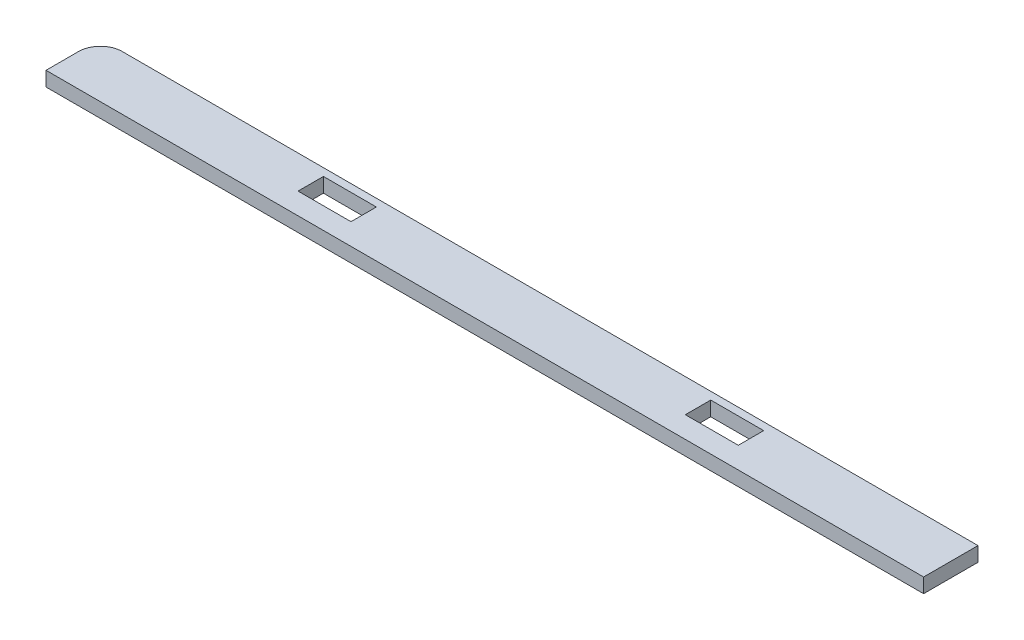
from build123d import *

# Parameters (mm, degrees)
SKETCH1_W           = 242
SKETCH1_H           = 15
BOSS_EXTRUDE1_DEPTH = 4
SKETCH2_W           = 14.6
SKETCH2_H           = 7
CUT_EXTRUDE1_DEPTH  = 172.166585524
SKETCH3_W           = 14.6
SKETCH3_H           = 7
CUT_EXTRUDE2_DEPTH  = 172.166585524
FILLET1_R           = 6


with BuildPart() as part:
    # Sketch1 → Boss-Extrude1 (new body)
    with BuildSketch(Plane(origin=(0, 3, 0), x_dir=(1, 0, 0), z_dir=(0, 1, 0))):
        with Locations((0, 113.5)):
            Rectangle(SKETCH1_W, SKETCH1_H)
    extrude(amount=-BOSS_EXTRUDE1_DEPTH)

    # Sketch2 → Cut-Extrude1 (cut, through all)
    with BuildSketch(Plane(origin=(0, 3, 0), x_dir=(-1, 0, 0), z_dir=(0, 1, 0))):
        with Locations((-56.7, -115.4)):
            Rectangle(SKETCH2_W, SKETCH2_H)
        with BuildLine():
            Line((-57.401923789, -116.9), (-53.4, -116.9))
            ThreePointArc((-53.4, -116.9), (-51.9, -115.4), (-53.4, -113.9))
            Line((-53.4, -113.9), (-57.401923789, -113.9))
            ThreePointArc((-57.401923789, -113.9), (-57, -115.4), (-57.401923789, -116.9))
        make_face(mode=Mode.SUBTRACT)
    extrude(amount=-CUT_EXTRUDE1_DEPTH, mode=Mode.SUBTRACT)


with BuildPart() as body_2:
    # of the pieces the cut leaves, the one that is kept (cut_extrude1_keep)
    add(part.part.solids().sort_by_distance((-121, 3, -106))[0])

    # Sketch3 → Cut-Extrude2 (cut, through all)
    with BuildSketch(Plane(origin=(0, 3, 0), x_dir=(-1, 0, 0), z_dir=(0, 1, 0))):
        with Locations((50.1, -115.4)):
            Rectangle(SKETCH3_W, SKETCH3_H)
        with BuildLine():
            Line((49.398076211, -116.9), (53.4, -116.9))
            ThreePointArc((53.4, -116.9), (54.9, -115.4), (53.4, -113.9))
            Line((53.4, -113.9), (49.398076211, -113.9))
            ThreePointArc((49.398076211, -113.9), (49.8, -115.4), (49.398076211, -116.9))
        make_face(mode=Mode.SUBTRACT)
    extrude(amount=-CUT_EXTRUDE2_DEPTH, mode=Mode.SUBTRACT)


with BuildPart() as body_2_2:
    # of the pieces the cut leaves, the one that is kept (cut_extrude2_keep)
    add(body_2.part.solids().sort_by_distance((-121, 3, -106))[0])

    # Fillet1
    fillet1_edges = [body_2_2.edges().sort_by_distance(p)[0] for p in [
        (-121, 1, -121),
    ]]
    fillet(fillet1_edges, radius=FILLET1_R)


solid = body_2_2.part
